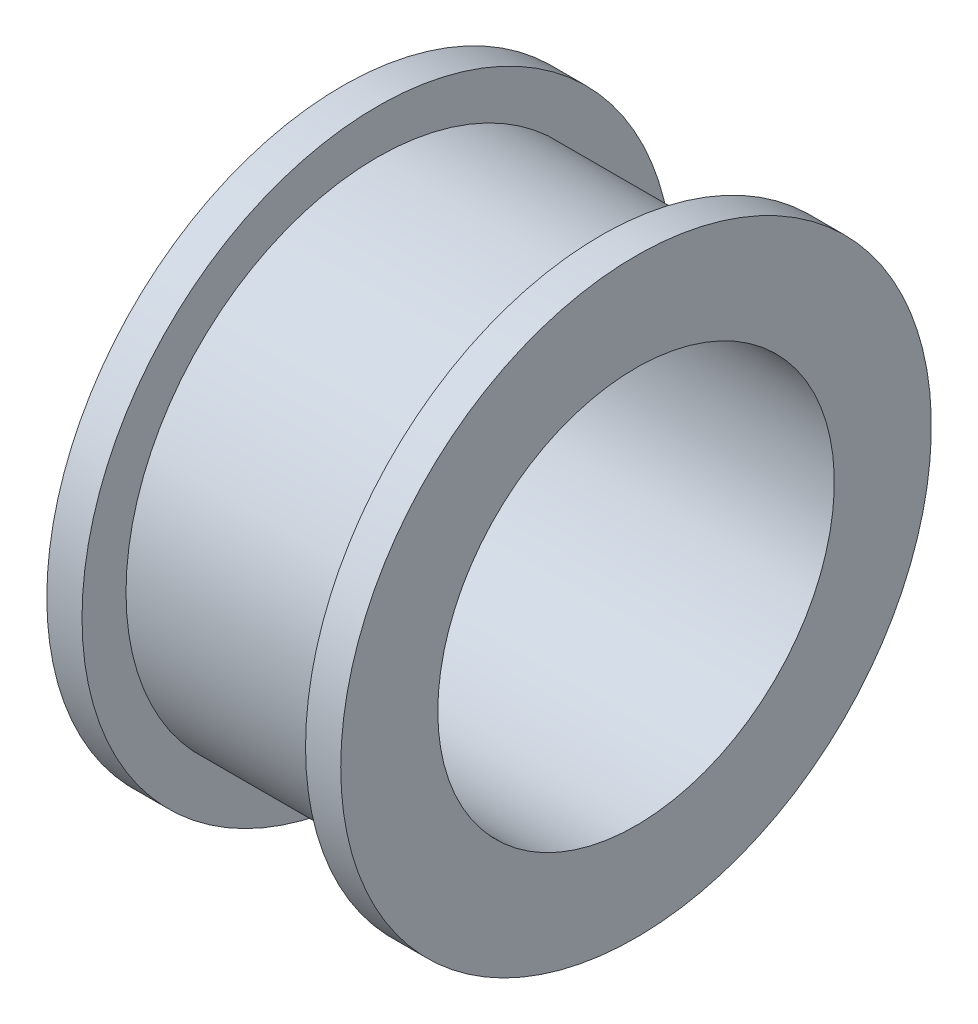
ISO-10303-21;
HEADER;
FILE_DESCRIPTION(('STEP AP214'),'2;1');
FILE_NAME('part.step','',(''),(''),'','','');
FILE_SCHEMA(('AUTOMOTIVE_DESIGN { 1 0 10303 214 1 1 1 1 }'));
ENDSEC;
DATA;
#1=APPLICATION_CONTEXT('core data for automotive mechanical design processes');
#2=APPLICATION_PROTOCOL_DEFINITION('international standard','automotive_design',2000,#1);
#3=PRODUCT_CONTEXT('',#1,'mechanical');
#4=PRODUCT('Part','Part','',(#3));
#5=PRODUCT_RELATED_PRODUCT_CATEGORY('part','',(#4));
#6=PRODUCT_DEFINITION_FORMATION('','',#4);
#7=PRODUCT_DEFINITION_CONTEXT('part definition',#1,'design');
#8=PRODUCT_DEFINITION('design','',#6,#7);
#9=PRODUCT_DEFINITION_SHAPE('','',#8);
#10=(LENGTH_UNIT() NAMED_UNIT(*) SI_UNIT(.MILLI.,.METRE.));
#11=(NAMED_UNIT(*) PLANE_ANGLE_UNIT() SI_UNIT($,.RADIAN.));
#12=(NAMED_UNIT(*) SI_UNIT($,.STERADIAN.) SOLID_ANGLE_UNIT());
#13=UNCERTAINTY_MEASURE_WITH_UNIT(LENGTH_MEASURE(1.E-05),#10,'distance_accuracy_value','');
#14=(GEOMETRIC_REPRESENTATION_CONTEXT(3) GLOBAL_UNCERTAINTY_ASSIGNED_CONTEXT((#13)) GLOBAL_UNIT_ASSIGNED_CONTEXT((#10,
#11,#12)) REPRESENTATION_CONTEXT('',''));
#15=CARTESIAN_POINT('',(0.,0.,0.));
#16=DIRECTION('',(0.,0.,1.));
#17=DIRECTION('',(1.,0.,0.));
#18=AXIS2_PLACEMENT_3D('',#15,#16,#17);
#19=CARTESIAN_POINT('',(-37.3661644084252,-14.9987,0.));
#20=DIRECTION('',(-1.,0.,0.));
#21=DIRECTION('',(0.,0.,1.));
#22=AXIS2_PLACEMENT_3D('',#19,#20,#21);
#23=CYLINDRICAL_SURFACE('',#22,14.30655);
#24=CARTESIAN_POINT('',(3.38336144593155,-14.9987,0.));
#25=DIRECTION('',(-1.,0.,0.));
#26=DIRECTION('',(0.,0.,1.));
#27=AXIS2_PLACEMENT_3D('',#24,#25,#26);
#28=CIRCLE('',#27,14.30655);
#29=CARTESIAN_POINT('',(3.38336144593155,-14.9987,14.30655));
#30=VERTEX_POINT('',#29);
#31=EDGE_CURVE('E71',#30,#30,#28,.T.);
#32=ORIENTED_EDGE('',*,*,#31,.F.);
#33=EDGE_LOOP('',(#32));
#34=FACE_BOUND('',#33,.T.);
#35=CARTESIAN_POINT('',(-17.8256385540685,-14.9987,0.));
#36=DIRECTION('',(-1.,0.,0.));
#37=DIRECTION('',(0.,0.,1.));
#38=AXIS2_PLACEMENT_3D('',#35,#36,#37);
#39=CIRCLE('',#38,14.30655);
#40=CARTESIAN_POINT('',(-17.8256385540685,-14.9987,14.30655));
#41=VERTEX_POINT('',#40);
#42=EDGE_CURVE('E10',#41,#41,#39,.T.);
#43=ORIENTED_EDGE('',*,*,#42,.T.);
#44=EDGE_LOOP('',(#43));
#45=FACE_BOUND('',#44,.T.);
#46=ADVANCED_FACE('F36',(#34,#45),#23,.F.);
#47=CARTESIAN_POINT('',(-17.8256385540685,-0.69215,0.));
#48=DIRECTION('',(1.,0.,0.));
#49=DIRECTION('',(0.,0.,-1.));
#50=AXIS2_PLACEMENT_3D('',#47,#48,#49);
#51=PLANE('',#50);
#52=ORIENTED_EDGE('',*,*,#42,.F.);
#53=EDGE_LOOP('',(#52));
#54=FACE_BOUND('',#53,.T.);
#55=CARTESIAN_POINT('',(-17.8256385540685,-14.9987,0.));
#56=DIRECTION('',(-1.,0.,0.));
#57=DIRECTION('',(0.,0.,1.));
#58=AXIS2_PLACEMENT_3D('',#55,#56,#57);
#59=CIRCLE('',#58,21.3106);
#60=CARTESIAN_POINT('',(-17.8256385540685,-14.9987,21.3106));
#61=VERTEX_POINT('',#60);
#62=EDGE_CURVE('E43',#61,#61,#59,.T.);
#63=ORIENTED_EDGE('',*,*,#62,.T.);
#64=EDGE_LOOP('',(#63));
#65=FACE_BOUND('',#64,.T.);
#66=ADVANCED_FACE('F79',(#54,#65),#51,.F.);
#67=CARTESIAN_POINT('',(-37.3661644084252,-14.9987,0.));
#68=DIRECTION('',(-1.,0.,0.));
#69=DIRECTION('',(0.,0.,1.));
#70=AXIS2_PLACEMENT_3D('',#67,#68,#69);
#71=CYLINDRICAL_SURFACE('',#70,21.3106);
#72=ORIENTED_EDGE('',*,*,#62,.F.);
#73=EDGE_LOOP('',(#72));
#74=FACE_BOUND('',#73,.T.);
#75=CARTESIAN_POINT('',(-15.2856385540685,-14.9987,0.));
#76=DIRECTION('',(-1.,0.,0.));
#77=DIRECTION('',(0.,0.,1.));
#78=AXIS2_PLACEMENT_3D('',#75,#76,#77);
#79=CIRCLE('',#78,21.3106);
#80=CARTESIAN_POINT('',(-15.2856385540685,-14.9987,21.3106));
#81=VERTEX_POINT('',#80);
#82=EDGE_CURVE('E50',#81,#81,#79,.T.);
#83=ORIENTED_EDGE('',*,*,#82,.T.);
#84=EDGE_LOOP('',(#83));
#85=FACE_BOUND('',#84,.T.);
#86=ADVANCED_FACE('F83',(#74,#85),#71,.T.);
#87=CARTESIAN_POINT('',(-15.2856385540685,6.3119,0.));
#88=DIRECTION('',(-1.,0.,0.));
#89=DIRECTION('',(0.,0.,1.));
#90=AXIS2_PLACEMENT_3D('',#87,#88,#89);
#91=PLANE('',#90);
#92=ORIENTED_EDGE('',*,*,#82,.F.);
#93=EDGE_LOOP('',(#92));
#94=FACE_BOUND('',#93,.T.);
#95=CARTESIAN_POINT('',(-15.2856385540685,-14.9987,0.));
#96=DIRECTION('',(-1.,0.,0.));
#97=DIRECTION('',(0.,0.,1.));
#98=AXIS2_PLACEMENT_3D('',#95,#96,#97);
#99=CIRCLE('',#98,18.1356);
#100=CARTESIAN_POINT('',(-15.2856385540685,-14.9987,18.1356));
#101=VERTEX_POINT('',#100);
#102=EDGE_CURVE('E56',#101,#101,#99,.T.);
#103=ORIENTED_EDGE('',*,*,#102,.T.);
#104=EDGE_LOOP('',(#103));
#105=FACE_BOUND('',#104,.T.);
#106=ADVANCED_FACE('F88',(#94,#105),#91,.F.);
#107=CARTESIAN_POINT('',(-37.3661644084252,-14.9987,0.));
#108=DIRECTION('',(-1.,0.,0.));
#109=DIRECTION('',(0.,0.,1.));
#110=AXIS2_PLACEMENT_3D('',#107,#108,#109);
#111=CYLINDRICAL_SURFACE('',#110,18.1356);
#112=ORIENTED_EDGE('',*,*,#102,.F.);
#113=EDGE_LOOP('',(#112));
#114=FACE_BOUND('',#113,.T.);
#115=CARTESIAN_POINT('',(0.843361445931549,-14.9987,0.));
#116=DIRECTION('',(-1.,0.,0.));
#117=DIRECTION('',(0.,0.,1.));
#118=AXIS2_PLACEMENT_3D('',#115,#116,#117);
#119=CIRCLE('',#118,18.1356);
#120=CARTESIAN_POINT('',(0.843361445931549,-14.9987,18.1356));
#121=VERTEX_POINT('',#120);
#122=EDGE_CURVE('E61',#121,#121,#119,.T.);
#123=ORIENTED_EDGE('',*,*,#122,.T.);
#124=EDGE_LOOP('',(#123));
#125=FACE_BOUND('',#124,.T.);
#126=ADVANCED_FACE('F94',(#114,#125),#111,.T.);
#127=CARTESIAN_POINT('',(0.843361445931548,3.1369,0.));
#128=DIRECTION('',(1.,0.,0.));
#129=DIRECTION('',(0.,0.,-1.));
#130=AXIS2_PLACEMENT_3D('',#127,#128,#129);
#131=PLANE('',#130);
#132=ORIENTED_EDGE('',*,*,#122,.F.);
#133=EDGE_LOOP('',(#132));
#134=FACE_BOUND('',#133,.T.);
#135=CARTESIAN_POINT('',(0.843361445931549,-14.9987,0.));
#136=DIRECTION('',(-1.,0.,0.));
#137=DIRECTION('',(0.,0.,1.));
#138=AXIS2_PLACEMENT_3D('',#135,#136,#137);
#139=CIRCLE('',#138,21.3106);
#140=CARTESIAN_POINT('',(0.843361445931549,-14.9987,21.3106));
#141=VERTEX_POINT('',#140);
#142=EDGE_CURVE('E64',#141,#141,#139,.T.);
#143=ORIENTED_EDGE('',*,*,#142,.T.);
#144=EDGE_LOOP('',(#143));
#145=FACE_BOUND('',#144,.T.);
#146=ADVANCED_FACE('F98',(#134,#145),#131,.F.);
#147=CARTESIAN_POINT('',(-37.3661644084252,-14.9987,0.));
#148=DIRECTION('',(-1.,0.,0.));
#149=DIRECTION('',(0.,0.,1.));
#150=AXIS2_PLACEMENT_3D('',#147,#148,#149);
#151=CYLINDRICAL_SURFACE('',#150,21.3106);
#152=ORIENTED_EDGE('',*,*,#142,.F.);
#153=EDGE_LOOP('',(#152));
#154=FACE_BOUND('',#153,.T.);
#155=CARTESIAN_POINT('',(3.38336144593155,-14.9987,0.));
#156=DIRECTION('',(-1.,0.,0.));
#157=DIRECTION('',(0.,0.,1.));
#158=AXIS2_PLACEMENT_3D('',#155,#156,#157);
#159=CIRCLE('',#158,21.3106);
#160=CARTESIAN_POINT('',(3.38336144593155,-14.9987,21.3106));
#161=VERTEX_POINT('',#160);
#162=EDGE_CURVE('E68',#161,#161,#159,.T.);
#163=ORIENTED_EDGE('',*,*,#162,.T.);
#164=EDGE_LOOP('',(#163));
#165=FACE_BOUND('',#164,.T.);
#166=ADVANCED_FACE('F102',(#154,#165),#151,.T.);
#167=CARTESIAN_POINT('',(3.38336144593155,6.3119,0.));
#168=DIRECTION('',(-1.,0.,0.));
#169=DIRECTION('',(0.,0.,1.));
#170=AXIS2_PLACEMENT_3D('',#167,#168,#169);
#171=PLANE('',#170);
#172=ORIENTED_EDGE('',*,*,#162,.F.);
#173=EDGE_LOOP('',(#172));
#174=FACE_BOUND('',#173,.T.);
#175=ORIENTED_EDGE('',*,*,#31,.T.);
#176=EDGE_LOOP('',(#175));
#177=FACE_BOUND('',#176,.T.);
#178=ADVANCED_FACE('F76',(#174,#177),#171,.F.);
#179=CLOSED_SHELL('',(#46,#66,#86,#106,#126,#146,#166,#178));
#180=MANIFOLD_SOLID_BREP('B2',#179);
#181=ADVANCED_BREP_SHAPE_REPRESENTATION('',(#18,#180),#14);
#182=SHAPE_DEFINITION_REPRESENTATION(#9,#181);
ENDSEC;
END-ISO-10303-21;
